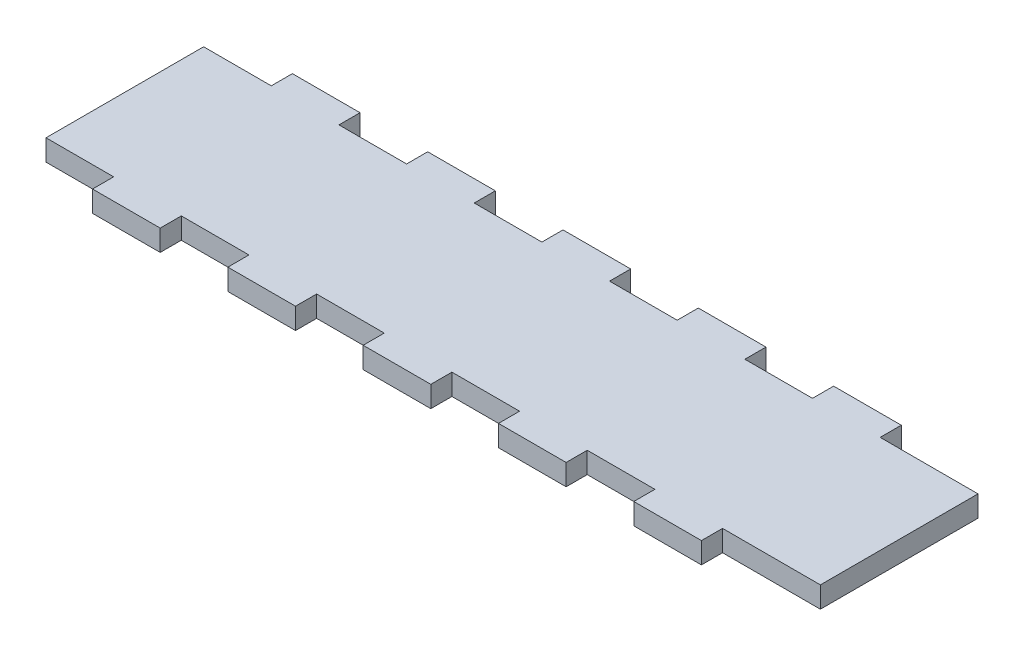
from build123d import *

# Parameters (mm, degrees)
BOSS_EXTRUDE1_DEPTH = 3.38


with BuildPart() as part:
    # Sketch1 → Boss-Extrude1 (new body)
    with BuildSketch(Plane(origin=(0, 0, 0), x_dir=(1, 0, 0), z_dir=(0, 1, 0))):
        Polygon((59, -12.62), (59, 0), (-65, 0), (-65, -12.62), (-54.166666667, -12.62), (-54.166666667, -16), (-43.333333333, -16), (-43.333333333, -12.62), (-32.5, -12.62), (-32.5, -16), (-21.666666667, -16), (-21.666666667, -12.62), (-10.833333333, -12.62), (-10.833333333, -16), (0, -16), (0, -12.62), (10.833333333, -12.62), (10.833333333, -16), (21.666666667, -16), (21.666666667, -12.62), (32.5, -12.62), (32.5, -16), (43.333333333, -16), (43.333333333, -12.62), align=None)
        Polygon((0, 12.62), (0, 16), (-10.833333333, 16), (-10.833333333, 12.62), (-21.666666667, 12.62), (-21.666666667, 16), (-32.5, 16), (-32.5, 12.62), (-43.333333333, 12.62), (-43.333333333, 16), (-54.166666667, 16), (-54.166666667, 12.62), (-65, 12.62), (-65, 0), (59, 0), (59, 12.62), (43.333333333, 12.62), (43.333333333, 16), (32.5, 16), (32.5, 12.62), (21.666666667, 12.62), (21.666666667, 16), (10.833333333, 16), (10.833333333, 12.62), align=None)
    extrude(amount=BOSS_EXTRUDE1_DEPTH)


solid = part.part
